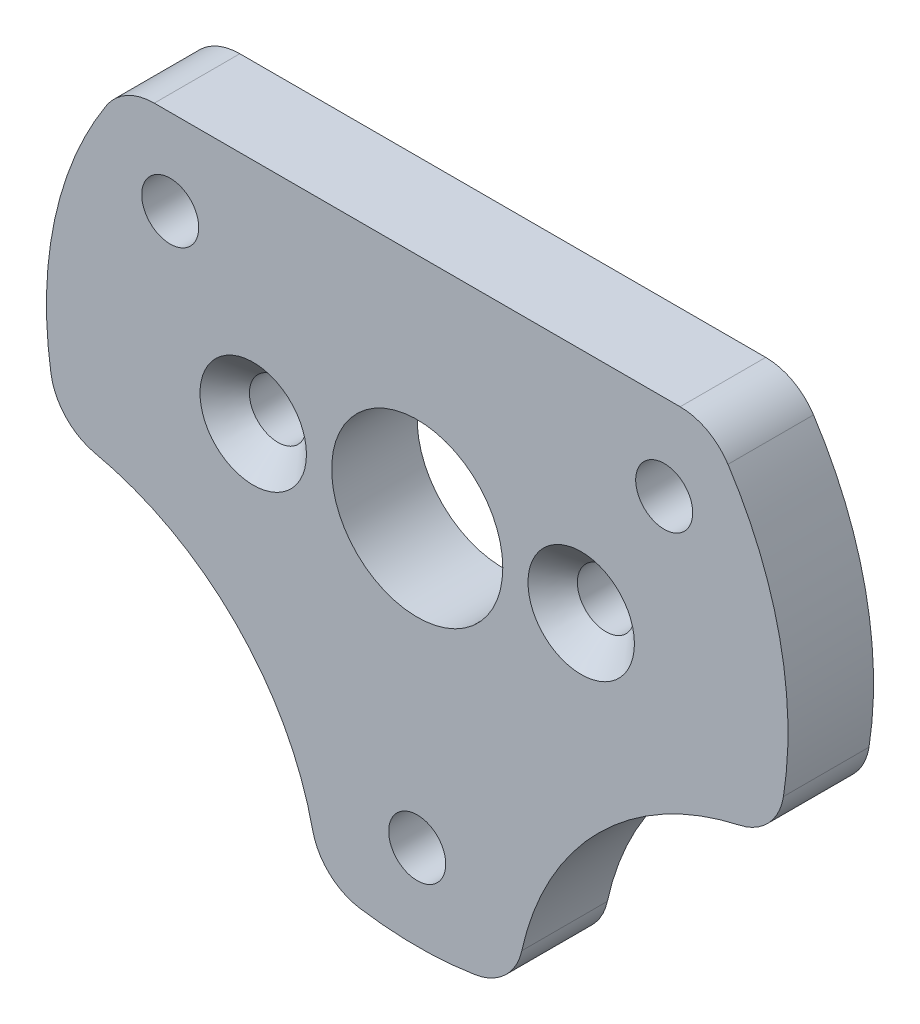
ISO-10303-21;
HEADER;
FILE_DESCRIPTION(('STEP AP214'),'2;1');
FILE_NAME('part.step','',(''),(''),'','','');
FILE_SCHEMA(('AUTOMOTIVE_DESIGN { 1 0 10303 214 1 1 1 1 }'));
ENDSEC;
DATA;
#1=APPLICATION_CONTEXT('core data for automotive mechanical design processes');
#2=APPLICATION_PROTOCOL_DEFINITION('international standard','automotive_design',2000,#1);
#3=PRODUCT_CONTEXT('',#1,'mechanical');
#4=PRODUCT('Part','Part','',(#3));
#5=PRODUCT_RELATED_PRODUCT_CATEGORY('part','',(#4));
#6=PRODUCT_DEFINITION_FORMATION('','',#4);
#7=PRODUCT_DEFINITION_CONTEXT('part definition',#1,'design');
#8=PRODUCT_DEFINITION('design','',#6,#7);
#9=PRODUCT_DEFINITION_SHAPE('','',#8);
#10=(LENGTH_UNIT() NAMED_UNIT(*) SI_UNIT(.MILLI.,.METRE.));
#11=(NAMED_UNIT(*) PLANE_ANGLE_UNIT() SI_UNIT($,.RADIAN.));
#12=(NAMED_UNIT(*) SI_UNIT($,.STERADIAN.) SOLID_ANGLE_UNIT());
#13=UNCERTAINTY_MEASURE_WITH_UNIT(LENGTH_MEASURE(1.E-05),#10,'distance_accuracy_value','');
#14=(GEOMETRIC_REPRESENTATION_CONTEXT(3) GLOBAL_UNCERTAINTY_ASSIGNED_CONTEXT((#13)) GLOBAL_UNIT_ASSIGNED_CONTEXT((#10,
#11,#12)) REPRESENTATION_CONTEXT('',''));
#15=CARTESIAN_POINT('',(0.,0.,0.));
#16=DIRECTION('',(0.,0.,1.));
#17=DIRECTION('',(1.,0.,0.));
#18=AXIS2_PLACEMENT_3D('',#15,#16,#17);
#19=CARTESIAN_POINT('',(0.,0.,3.));
#20=DIRECTION('',(0.,0.,-1.));
#21=DIRECTION('',(-1.,0.,0.));
#22=AXIS2_PLACEMENT_3D('',#19,#20,#21);
#23=CYLINDRICAL_SURFACE('',#22,13.);
#24=CARTESIAN_POINT('',(0.,0.,0.));
#25=DIRECTION('',(0.,0.,1.));
#26=DIRECTION('',(1.,0.,0.));
#27=AXIS2_PLACEMENT_3D('',#24,#25,#26);
#28=CIRCLE('',#27,13.);
#29=CARTESIAN_POINT('',(-2.02481441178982,-12.8413444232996,0.));
#30=VERTEX_POINT('',#29);
#31=CARTESIAN_POINT('',(2.02481441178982,-12.8413444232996,0.));
#32=VERTEX_POINT('',#31);
#33=EDGE_CURVE('E259',#30,#32,#28,.T.);
#34=ORIENTED_EDGE('',*,*,#33,.T.);
#35=DIRECTION('',(0.,0.,-1.));
#36=VECTOR('',#35,1.);
#37=CARTESIAN_POINT('',(2.02481441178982,-12.8413444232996,3.));
#38=LINE('',#37,#36);
#39=CARTESIAN_POINT('',(2.02481441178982,-12.8413444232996,3.));
#40=VERTEX_POINT('',#39);
#41=EDGE_CURVE('E183',#32,#40,#38,.F.);
#42=ORIENTED_EDGE('',*,*,#41,.T.);
#43=CARTESIAN_POINT('',(0.,0.,3.));
#44=DIRECTION('',(0.,0.,1.));
#45=DIRECTION('',(1.,0.,0.));
#46=AXIS2_PLACEMENT_3D('',#43,#44,#45);
#47=CIRCLE('',#46,13.);
#48=CARTESIAN_POINT('',(-2.02481441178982,-12.8413444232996,3.));
#49=VERTEX_POINT('',#48);
#50=EDGE_CURVE('E147',#49,#40,#47,.T.);
#51=ORIENTED_EDGE('',*,*,#50,.F.);
#52=DIRECTION('',(0.,0.,-1.));
#53=VECTOR('',#52,1.);
#54=CARTESIAN_POINT('',(-2.02481441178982,-12.8413444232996,3.));
#55=LINE('',#54,#53);
#56=EDGE_CURVE('E137',#49,#30,#55,.T.);
#57=ORIENTED_EDGE('',*,*,#56,.T.);
#58=EDGE_LOOP('',(#34,#42,#51,#57));
#59=FACE_BOUND('',#58,.T.);
#60=ADVANCED_FACE('F34',(#59),#23,.T.);
#61=CARTESIAN_POINT('',(-10.8958252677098,7.09090909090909,0.));
#62=VERTEX_POINT('',#61);
#63=CARTESIAN_POINT('',(-12.8413444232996,-2.02481441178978,0.));
#64=VERTEX_POINT('',#63);
#65=EDGE_CURVE('E257',#62,#64,#28,.T.);
#66=ORIENTED_EDGE('',*,*,#65,.T.);
#67=DIRECTION('',(0.,0.,-1.));
#68=VECTOR('',#67,1.);
#69=CARTESIAN_POINT('',(-12.8413444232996,-2.02481441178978,3.));
#70=LINE('',#69,#68);
#71=CARTESIAN_POINT('',(-12.8413444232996,-2.02481441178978,3.));
#72=VERTEX_POINT('',#71);
#73=EDGE_CURVE('E192',#64,#72,#70,.F.);
#74=ORIENTED_EDGE('',*,*,#73,.T.);
#75=CARTESIAN_POINT('',(-10.8958252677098,7.09090909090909,3.));
#76=VERTEX_POINT('',#75);
#77=EDGE_CURVE('E150',#76,#72,#47,.T.);
#78=ORIENTED_EDGE('',*,*,#77,.F.);
#79=DIRECTION('',(0.,0.,-1.));
#80=VECTOR('',#79,1.);
#81=CARTESIAN_POINT('',(-10.8958252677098,7.09090909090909,3.));
#82=LINE('',#81,#80);
#83=EDGE_CURVE('E189',#76,#62,#82,.T.);
#84=ORIENTED_EDGE('',*,*,#83,.T.);
#85=EDGE_LOOP('',(#66,#74,#78,#84));
#86=FACE_BOUND('',#85,.T.);
#87=ADVANCED_FACE('F274',(#86),#23,.T.);
#88=CARTESIAN_POINT('',(0.,0.,3.));
#89=DIRECTION('',(0.,0.,1.));
#90=DIRECTION('',(1.,0.,0.));
#91=AXIS2_PLACEMENT_3D('',#88,#89,#90);
#92=PLANE('',#91);
#93=CARTESIAN_POINT('',(5.75,0.,3.));
#94=DIRECTION('',(0.,0.,1.));
#95=DIRECTION('',(1.,0.,0.));
#96=AXIS2_PLACEMENT_3D('',#93,#94,#95);
#97=CIRCLE('',#96,1.866);
#98=CARTESIAN_POINT('',(7.616,0.,3.));
#99=VERTEX_POINT('',#98);
#100=EDGE_CURVE('E42',#99,#99,#97,.F.);
#101=ORIENTED_EDGE('',*,*,#100,.T.);
#102=EDGE_LOOP('',(#101));
#103=FACE_BOUND('',#102,.T.);
#104=CARTESIAN_POINT('',(-5.75,0.,3.));
#105=DIRECTION('',(0.,0.,1.));
#106=DIRECTION('',(1.,0.,0.));
#107=AXIS2_PLACEMENT_3D('',#104,#105,#106);
#108=CIRCLE('',#107,1.866);
#109=CARTESIAN_POINT('',(-3.884,0.,3.));
#110=VERTEX_POINT('',#109);
#111=EDGE_CURVE('E203',#110,#110,#108,.F.);
#112=ORIENTED_EDGE('',*,*,#111,.T.);
#113=EDGE_LOOP('',(#112));
#114=FACE_BOUND('',#113,.T.);
#115=CARTESIAN_POINT('',(13.4350288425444,-13.4350288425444,3.));
#116=DIRECTION('',(0.,0.,1.));
#117=DIRECTION('',(1.,0.,0.));
#118=AXIS2_PLACEMENT_3D('',#115,#116,#117);
#119=CIRCLE('',#118,10.);
#120=CARTESIAN_POINT('',(11.2939656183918,-3.66692522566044,3.));
#121=VERTEX_POINT('',#120);
#122=CARTESIAN_POINT('',(3.66692522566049,-11.2939656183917,3.));
#123=VERTEX_POINT('',#122);
#124=EDGE_CURVE('E133',#121,#123,#119,.T.);
#125=ORIENTED_EDGE('',*,*,#124,.F.);
#126=CARTESIAN_POINT('',(10.8657529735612,-1.71330450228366,3.));
#127=DIRECTION('',(0.,0.,1.));
#128=DIRECTION('',(1.,0.,0.));
#129=AXIS2_PLACEMENT_3D('',#126,#127,#128);
#130=CIRCLE('',#129,2.);
#131=CARTESIAN_POINT('',(12.8413444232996,-2.02481441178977,3.));
#132=VERTEX_POINT('',#131);
#133=EDGE_CURVE('E126',#121,#132,#130,.T.);
#134=ORIENTED_EDGE('',*,*,#133,.T.);
#135=CARTESIAN_POINT('',(10.8958252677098,7.09090909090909,3.));
#136=VERTEX_POINT('',#135);
#137=EDGE_CURVE('E130',#132,#136,#47,.T.);
#138=ORIENTED_EDGE('',*,*,#137,.T.);
#139=CARTESIAN_POINT('',(9.21954445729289,6.,3.));
#140=DIRECTION('',(0.,0.,1.));
#141=DIRECTION('',(1.,0.,0.));
#142=AXIS2_PLACEMENT_3D('',#139,#140,#141);
#143=CIRCLE('',#142,2.);
#144=CARTESIAN_POINT('',(9.21954445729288,8.,3.));
#145=VERTEX_POINT('',#144);
#146=EDGE_CURVE('E175',#136,#145,#143,.T.);
#147=ORIENTED_EDGE('',*,*,#146,.T.);
#148=DIRECTION('',(-1.,0.,0.));
#149=VECTOR('',#148,1.);
#150=CARTESIAN_POINT('',(-10.2469507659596,8.,3.));
#151=LINE('',#150,#149);
#152=CARTESIAN_POINT('',(-9.21954445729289,8.,3.));
#153=VERTEX_POINT('',#152);
#154=EDGE_CURVE('E157',#145,#153,#151,.T.);
#155=ORIENTED_EDGE('',*,*,#154,.T.);
#156=CARTESIAN_POINT('',(-9.21954445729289,6.,3.));
#157=DIRECTION('',(0.,0.,1.));
#158=DIRECTION('',(1.,0.,0.));
#159=AXIS2_PLACEMENT_3D('',#156,#157,#158);
#160=CIRCLE('',#159,2.);
#161=EDGE_CURVE('E173',#153,#76,#160,.T.);
#162=ORIENTED_EDGE('',*,*,#161,.T.);
#163=ORIENTED_EDGE('',*,*,#77,.T.);
#164=CARTESIAN_POINT('',(-10.8657529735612,-1.71330450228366,3.));
#165=DIRECTION('',(0.,0.,1.));
#166=DIRECTION('',(1.,0.,0.));
#167=AXIS2_PLACEMENT_3D('',#164,#165,#166);
#168=CIRCLE('',#167,2.);
#169=CARTESIAN_POINT('',(-11.2939656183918,-3.66692522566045,3.));
#170=VERTEX_POINT('',#169);
#171=EDGE_CURVE('E177',#72,#170,#168,.T.);
#172=ORIENTED_EDGE('',*,*,#171,.T.);
#173=CARTESIAN_POINT('',(-13.4350288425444,-13.4350288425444,3.));
#174=DIRECTION('',(0.,0.,1.));
#175=DIRECTION('',(-1.,0.,0.));
#176=AXIS2_PLACEMENT_3D('',#173,#174,#175);
#177=CIRCLE('',#176,10.);
#178=CARTESIAN_POINT('',(-3.66692522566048,-11.2939656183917,3.));
#179=VERTEX_POINT('',#178);
#180=EDGE_CURVE('E282',#179,#170,#177,.T.);
#181=ORIENTED_EDGE('',*,*,#180,.F.);
#182=CARTESIAN_POINT('',(-1.71330450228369,-10.8657529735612,3.));
#183=DIRECTION('',(0.,0.,1.));
#184=DIRECTION('',(1.,0.,0.));
#185=AXIS2_PLACEMENT_3D('',#182,#183,#184);
#186=CIRCLE('',#185,2.);
#187=EDGE_CURVE('E57',#179,#49,#186,.T.);
#188=ORIENTED_EDGE('',*,*,#187,.T.);
#189=ORIENTED_EDGE('',*,*,#50,.T.);
#190=CARTESIAN_POINT('',(1.7133045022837,-10.8657529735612,3.));
#191=DIRECTION('',(0.,0.,1.));
#192=DIRECTION('',(1.,0.,0.));
#193=AXIS2_PLACEMENT_3D('',#190,#191,#192);
#194=CIRCLE('',#193,2.);
#195=EDGE_CURVE('E49',#40,#123,#194,.T.);
#196=ORIENTED_EDGE('',*,*,#195,.T.);
#197=EDGE_LOOP('',(#125,#134,#138,#147,#155,#162,#163,#172,#181,#188,#189,#196));
#198=FACE_BOUND('',#197,.T.);
#199=CARTESIAN_POINT('',(8.66025403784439,5.,3.));
#200=DIRECTION('',(0.,0.,1.));
#201=DIRECTION('',(1.,0.,0.));
#202=AXIS2_PLACEMENT_3D('',#199,#200,#201);
#203=CIRCLE('',#202,1.);
#204=CARTESIAN_POINT('',(9.66025403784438,5.,3.));
#205=VERTEX_POINT('',#204);
#206=EDGE_CURVE('E237',#205,#205,#203,.T.);
#207=ORIENTED_EDGE('',*,*,#206,.F.);
#208=EDGE_LOOP('',(#207));
#209=FACE_BOUND('',#208,.T.);
#210=CARTESIAN_POINT('',(0.,-10.,3.));
#211=DIRECTION('',(0.,0.,1.));
#212=DIRECTION('',(1.,0.,0.));
#213=AXIS2_PLACEMENT_3D('',#210,#211,#212);
#214=CIRCLE('',#213,1.);
#215=CARTESIAN_POINT('',(1.,-10.,3.));
#216=VERTEX_POINT('',#215);
#217=EDGE_CURVE('E249',#216,#216,#214,.T.);
#218=ORIENTED_EDGE('',*,*,#217,.F.);
#219=EDGE_LOOP('',(#218));
#220=FACE_BOUND('',#219,.T.);
#221=CARTESIAN_POINT('',(-8.66025403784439,5.,3.));
#222=DIRECTION('',(0.,0.,1.));
#223=DIRECTION('',(1.,0.,0.));
#224=AXIS2_PLACEMENT_3D('',#221,#222,#223);
#225=CIRCLE('',#224,1.);
#226=CARTESIAN_POINT('',(-7.66025403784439,5.,3.));
#227=VERTEX_POINT('',#226);
#228=EDGE_CURVE('E243',#227,#227,#225,.T.);
#229=ORIENTED_EDGE('',*,*,#228,.F.);
#230=EDGE_LOOP('',(#229));
#231=FACE_BOUND('',#230,.T.);
#232=CARTESIAN_POINT('',(0.,0.,3.));
#233=DIRECTION('',(0.,0.,1.));
#234=DIRECTION('',(1.,0.,0.));
#235=AXIS2_PLACEMENT_3D('',#232,#233,#234);
#236=CIRCLE('',#235,3.);
#237=CARTESIAN_POINT('',(3.,0.,3.));
#238=VERTEX_POINT('',#237);
#239=EDGE_CURVE('E227',#238,#238,#236,.T.);
#240=ORIENTED_EDGE('',*,*,#239,.F.);
#241=EDGE_LOOP('',(#240));
#242=FACE_BOUND('',#241,.T.);
#243=ADVANCED_FACE('F128',(#103,#114,#198,#209,#220,#231,#242),#92,.T.);
#244=CARTESIAN_POINT('',(0.,0.,0.));
#245=DIRECTION('',(0.,0.,1.));
#246=DIRECTION('',(1.,0.,0.));
#247=AXIS2_PLACEMENT_3D('',#244,#245,#246);
#248=PLANE('',#247);
#249=CARTESIAN_POINT('',(12.8413444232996,-2.02481441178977,0.));
#250=VERTEX_POINT('',#249);
#251=CARTESIAN_POINT('',(10.8958252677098,7.09090909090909,0.));
#252=VERTEX_POINT('',#251);
#253=EDGE_CURVE('E252',#250,#252,#28,.T.);
#254=ORIENTED_EDGE('',*,*,#253,.F.);
#255=CARTESIAN_POINT('',(10.8657529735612,-1.71330450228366,0.));
#256=DIRECTION('',(0.,0.,1.));
#257=DIRECTION('',(1.,0.,0.));
#258=AXIS2_PLACEMENT_3D('',#255,#256,#257);
#259=CIRCLE('',#258,2.);
#260=CARTESIAN_POINT('',(11.2939656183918,-3.66692522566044,0.));
#261=VERTEX_POINT('',#260);
#262=EDGE_CURVE('E152',#250,#261,#259,.F.);
#263=ORIENTED_EDGE('',*,*,#262,.T.);
#264=CARTESIAN_POINT('',(13.4350288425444,-13.4350288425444,0.));
#265=DIRECTION('',(0.,0.,1.));
#266=DIRECTION('',(1.,0.,0.));
#267=AXIS2_PLACEMENT_3D('',#264,#265,#266);
#268=CIRCLE('',#267,10.);
#269=CARTESIAN_POINT('',(3.66692522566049,-11.2939656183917,0.));
#270=VERTEX_POINT('',#269);
#271=EDGE_CURVE('E289',#261,#270,#268,.T.);
#272=ORIENTED_EDGE('',*,*,#271,.T.);
#273=CARTESIAN_POINT('',(1.7133045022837,-10.8657529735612,0.));
#274=DIRECTION('',(0.,0.,1.));
#275=DIRECTION('',(1.,0.,0.));
#276=AXIS2_PLACEMENT_3D('',#273,#274,#275);
#277=CIRCLE('',#276,2.);
#278=EDGE_CURVE('E166',#270,#32,#277,.F.);
#279=ORIENTED_EDGE('',*,*,#278,.T.);
#280=ORIENTED_EDGE('',*,*,#33,.F.);
#281=CARTESIAN_POINT('',(-1.71330450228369,-10.8657529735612,0.));
#282=DIRECTION('',(0.,0.,1.));
#283=DIRECTION('',(1.,0.,0.));
#284=AXIS2_PLACEMENT_3D('',#281,#282,#283);
#285=CIRCLE('',#284,2.);
#286=CARTESIAN_POINT('',(-3.66692522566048,-11.2939656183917,0.));
#287=VERTEX_POINT('',#286);
#288=EDGE_CURVE('E164',#30,#287,#285,.F.);
#289=ORIENTED_EDGE('',*,*,#288,.T.);
#290=CARTESIAN_POINT('',(-13.4350288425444,-13.4350288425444,0.));
#291=DIRECTION('',(0.,0.,1.));
#292=DIRECTION('',(1.,0.,0.));
#293=AXIS2_PLACEMENT_3D('',#290,#291,#292);
#294=CIRCLE('',#293,10.);
#295=CARTESIAN_POINT('',(-11.2939656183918,-3.66692522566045,0.));
#296=VERTEX_POINT('',#295);
#297=EDGE_CURVE('E288',#287,#296,#294,.T.);
#298=ORIENTED_EDGE('',*,*,#297,.T.);
#299=CARTESIAN_POINT('',(-10.8657529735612,-1.71330450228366,0.));
#300=DIRECTION('',(0.,0.,1.));
#301=DIRECTION('',(1.,0.,0.));
#302=AXIS2_PLACEMENT_3D('',#299,#300,#301);
#303=CIRCLE('',#302,2.);
#304=EDGE_CURVE('E162',#296,#64,#303,.F.);
#305=ORIENTED_EDGE('',*,*,#304,.T.);
#306=ORIENTED_EDGE('',*,*,#65,.F.);
#307=CARTESIAN_POINT('',(-9.21954445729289,6.,0.));
#308=DIRECTION('',(0.,0.,1.));
#309=DIRECTION('',(1.,0.,0.));
#310=AXIS2_PLACEMENT_3D('',#307,#308,#309);
#311=CIRCLE('',#310,2.);
#312=CARTESIAN_POINT('',(-9.21954445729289,8.,0.));
#313=VERTEX_POINT('',#312);
#314=EDGE_CURVE('E153',#62,#313,#311,.F.);
#315=ORIENTED_EDGE('',*,*,#314,.T.);
#316=DIRECTION('',(-1.,0.,0.));
#317=VECTOR('',#316,1.);
#318=CARTESIAN_POINT('',(-10.2469507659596,8.,0.));
#319=LINE('',#318,#317);
#320=CARTESIAN_POINT('',(9.21954445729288,8.,0.));
#321=VERTEX_POINT('',#320);
#322=EDGE_CURVE('E148',#321,#313,#319,.T.);
#323=ORIENTED_EDGE('',*,*,#322,.F.);
#324=CARTESIAN_POINT('',(9.21954445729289,6.,0.));
#325=DIRECTION('',(0.,0.,1.));
#326=DIRECTION('',(1.,0.,0.));
#327=AXIS2_PLACEMENT_3D('',#324,#325,#326);
#328=CIRCLE('',#327,2.);
#329=EDGE_CURVE('E155',#321,#252,#328,.F.);
#330=ORIENTED_EDGE('',*,*,#329,.T.);
#331=EDGE_LOOP('',(#254,#263,#272,#279,#280,#289,#298,#305,#306,#315,#323,#330));
#332=FACE_BOUND('',#331,.T.);
#333=CARTESIAN_POINT('',(0.,-10.,0.));
#334=DIRECTION('',(0.,0.,1.));
#335=DIRECTION('',(1.,0.,0.));
#336=AXIS2_PLACEMENT_3D('',#333,#334,#335);
#337=CIRCLE('',#336,1.);
#338=CARTESIAN_POINT('',(1.,-10.,0.));
#339=VERTEX_POINT('',#338);
#340=EDGE_CURVE('E246',#339,#339,#337,.T.);
#341=ORIENTED_EDGE('',*,*,#340,.T.);
#342=EDGE_LOOP('',(#341));
#343=FACE_BOUND('',#342,.T.);
#344=CARTESIAN_POINT('',(-8.66025403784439,5.,0.));
#345=DIRECTION('',(0.,0.,1.));
#346=DIRECTION('',(1.,0.,0.));
#347=AXIS2_PLACEMENT_3D('',#344,#345,#346);
#348=CIRCLE('',#347,1.);
#349=CARTESIAN_POINT('',(-7.66025403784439,5.,0.));
#350=VERTEX_POINT('',#349);
#351=EDGE_CURVE('E240',#350,#350,#348,.T.);
#352=ORIENTED_EDGE('',*,*,#351,.T.);
#353=EDGE_LOOP('',(#352));
#354=FACE_BOUND('',#353,.T.);
#355=CARTESIAN_POINT('',(8.66025403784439,5.,0.));
#356=DIRECTION('',(0.,0.,1.));
#357=DIRECTION('',(1.,0.,0.));
#358=AXIS2_PLACEMENT_3D('',#355,#356,#357);
#359=CIRCLE('',#358,1.);
#360=CARTESIAN_POINT('',(9.66025403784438,5.,0.));
#361=VERTEX_POINT('',#360);
#362=EDGE_CURVE('E230',#361,#361,#359,.T.);
#363=ORIENTED_EDGE('',*,*,#362,.T.);
#364=EDGE_LOOP('',(#363));
#365=FACE_BOUND('',#364,.T.);
#366=CARTESIAN_POINT('',(-5.75,0.,0.));
#367=DIRECTION('',(0.,0.,1.));
#368=DIRECTION('',(1.,0.,0.));
#369=AXIS2_PLACEMENT_3D('',#366,#367,#368);
#370=CIRCLE('',#369,1.);
#371=CARTESIAN_POINT('',(-4.75,0.,0.));
#372=VERTEX_POINT('',#371);
#373=EDGE_CURVE('E226',#372,#372,#370,.T.);
#374=ORIENTED_EDGE('',*,*,#373,.T.);
#375=EDGE_LOOP('',(#374));
#376=FACE_BOUND('',#375,.T.);
#377=CARTESIAN_POINT('',(5.75,0.,0.));
#378=DIRECTION('',(0.,0.,1.));
#379=DIRECTION('',(-1.,0.,0.));
#380=AXIS2_PLACEMENT_3D('',#377,#378,#379);
#381=CIRCLE('',#380,1.);
#382=CARTESIAN_POINT('',(4.75,0.,0.));
#383=VERTEX_POINT('',#382);
#384=EDGE_CURVE('E224',#383,#383,#381,.T.);
#385=ORIENTED_EDGE('',*,*,#384,.T.);
#386=EDGE_LOOP('',(#385));
#387=FACE_BOUND('',#386,.T.);
#388=CARTESIAN_POINT('',(0.,0.,0.));
#389=DIRECTION('',(0.,0.,1.));
#390=DIRECTION('',(1.,0.,0.));
#391=AXIS2_PLACEMENT_3D('',#388,#389,#390);
#392=CIRCLE('',#391,3.);
#393=CARTESIAN_POINT('',(3.,0.,0.));
#394=VERTEX_POINT('',#393);
#395=EDGE_CURVE('E233',#394,#394,#392,.T.);
#396=ORIENTED_EDGE('',*,*,#395,.T.);
#397=EDGE_LOOP('',(#396));
#398=FACE_BOUND('',#397,.T.);
#399=ADVANCED_FACE('F302',(#332,#343,#354,#365,#376,#387,#398),#248,.F.);
#400=ORIENTED_EDGE('',*,*,#137,.F.);
#401=DIRECTION('',(0.,0.,-1.));
#402=VECTOR('',#401,1.);
#403=CARTESIAN_POINT('',(12.8413444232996,-2.02481441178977,3.));
#404=LINE('',#403,#402);
#405=EDGE_CURVE('E143',#132,#250,#404,.T.);
#406=ORIENTED_EDGE('',*,*,#405,.T.);
#407=ORIENTED_EDGE('',*,*,#253,.T.);
#408=DIRECTION('',(0.,0.,-1.));
#409=VECTOR('',#408,1.);
#410=CARTESIAN_POINT('',(10.8958252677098,7.09090909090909,3.));
#411=LINE('',#410,#409);
#412=EDGE_CURVE('E146',#252,#136,#411,.F.);
#413=ORIENTED_EDGE('',*,*,#412,.T.);
#414=EDGE_LOOP('',(#400,#406,#407,#413));
#415=FACE_BOUND('',#414,.T.);
#416=ADVANCED_FACE('F141',(#415),#23,.T.);
#417=CARTESIAN_POINT('',(-10.2469507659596,8.,3.));
#418=DIRECTION('',(0.,-1.,0.));
#419=DIRECTION('',(0.,0.,-1.));
#420=AXIS2_PLACEMENT_3D('',#417,#418,#419);
#421=PLANE('',#420);
#422=ORIENTED_EDGE('',*,*,#154,.F.);
#423=DIRECTION('',(0.,0.,-1.));
#424=VECTOR('',#423,1.);
#425=CARTESIAN_POINT('',(9.21954445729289,8.,3.));
#426=LINE('',#425,#424);
#427=EDGE_CURVE('E197',#145,#321,#426,.T.);
#428=ORIENTED_EDGE('',*,*,#427,.T.);
#429=ORIENTED_EDGE('',*,*,#322,.T.);
#430=DIRECTION('',(0.,0.,-1.));
#431=VECTOR('',#430,1.);
#432=CARTESIAN_POINT('',(-9.21954445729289,8.,3.));
#433=LINE('',#432,#431);
#434=EDGE_CURVE('E195',#313,#153,#433,.F.);
#435=ORIENTED_EDGE('',*,*,#434,.T.);
#436=EDGE_LOOP('',(#422,#428,#429,#435));
#437=FACE_BOUND('',#436,.T.);
#438=ADVANCED_FACE('F265',(#437),#421,.F.);
#439=CARTESIAN_POINT('',(0.,-10.,3.));
#440=DIRECTION('',(0.,0.,-1.));
#441=DIRECTION('',(-1.,0.,0.));
#442=AXIS2_PLACEMENT_3D('',#439,#440,#441);
#443=CYLINDRICAL_SURFACE('',#442,1.);
#444=ORIENTED_EDGE('',*,*,#217,.T.);
#445=EDGE_LOOP('',(#444));
#446=FACE_BOUND('',#445,.T.);
#447=ORIENTED_EDGE('',*,*,#340,.F.);
#448=EDGE_LOOP('',(#447));
#449=FACE_BOUND('',#448,.T.);
#450=ADVANCED_FACE('F329',(#446,#449),#443,.F.);
#451=CARTESIAN_POINT('',(-8.66025403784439,5.,3.));
#452=DIRECTION('',(0.,0.,-1.));
#453=DIRECTION('',(-1.,0.,0.));
#454=AXIS2_PLACEMENT_3D('',#451,#452,#453);
#455=CYLINDRICAL_SURFACE('',#454,1.);
#456=ORIENTED_EDGE('',*,*,#228,.T.);
#457=EDGE_LOOP('',(#456));
#458=FACE_BOUND('',#457,.T.);
#459=ORIENTED_EDGE('',*,*,#351,.F.);
#460=EDGE_LOOP('',(#459));
#461=FACE_BOUND('',#460,.T.);
#462=ADVANCED_FACE('F338',(#458,#461),#455,.F.);
#463=CARTESIAN_POINT('',(8.66025403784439,5.,3.));
#464=DIRECTION('',(0.,0.,-1.));
#465=DIRECTION('',(-1.,0.,0.));
#466=AXIS2_PLACEMENT_3D('',#463,#464,#465);
#467=CYLINDRICAL_SURFACE('',#466,1.);
#468=ORIENTED_EDGE('',*,*,#206,.T.);
#469=EDGE_LOOP('',(#468));
#470=FACE_BOUND('',#469,.T.);
#471=ORIENTED_EDGE('',*,*,#362,.F.);
#472=EDGE_LOOP('',(#471));
#473=FACE_BOUND('',#472,.T.);
#474=ADVANCED_FACE('F342',(#470,#473),#467,.F.);
#475=CARTESIAN_POINT('',(-5.75,0.,3.));
#476=DIRECTION('',(0.,0.,-1.));
#477=DIRECTION('',(-1.,0.,0.));
#478=AXIS2_PLACEMENT_3D('',#475,#476,#477);
#479=CYLINDRICAL_SURFACE('',#478,1.);
#480=CARTESIAN_POINT('',(-5.75,0.,2.134));
#481=DIRECTION('',(0.,0.,1.));
#482=DIRECTION('',(1.,0.,0.));
#483=AXIS2_PLACEMENT_3D('',#480,#481,#482);
#484=CIRCLE('',#483,1.);
#485=CARTESIAN_POINT('',(-4.75,0.,2.134));
#486=VERTEX_POINT('',#485);
#487=EDGE_CURVE('E11',#486,#486,#484,.T.);
#488=ORIENTED_EDGE('',*,*,#487,.T.);
#489=EDGE_LOOP('',(#488));
#490=FACE_BOUND('',#489,.T.);
#491=ORIENTED_EDGE('',*,*,#373,.F.);
#492=EDGE_LOOP('',(#491));
#493=FACE_BOUND('',#492,.T.);
#494=ADVANCED_FACE('F220',(#490,#493),#479,.F.);
#495=CARTESIAN_POINT('',(5.75,0.,3.));
#496=DIRECTION('',(0.,0.,-1.));
#497=DIRECTION('',(-1.,0.,0.));
#498=AXIS2_PLACEMENT_3D('',#495,#496,#497);
#499=CYLINDRICAL_SURFACE('',#498,1.);
#500=CARTESIAN_POINT('',(5.75,0.,2.134));
#501=DIRECTION('',(0.,0.,1.));
#502=DIRECTION('',(1.,0.,0.));
#503=AXIS2_PLACEMENT_3D('',#500,#501,#502);
#504=CIRCLE('',#503,1.);
#505=CARTESIAN_POINT('',(6.75,0.,2.134));
#506=VERTEX_POINT('',#505);
#507=EDGE_CURVE('E200',#506,#506,#504,.T.);
#508=ORIENTED_EDGE('',*,*,#507,.T.);
#509=EDGE_LOOP('',(#508));
#510=FACE_BOUND('',#509,.T.);
#511=ORIENTED_EDGE('',*,*,#384,.F.);
#512=EDGE_LOOP('',(#511));
#513=FACE_BOUND('',#512,.T.);
#514=ADVANCED_FACE('F216',(#510,#513),#499,.F.);
#515=CARTESIAN_POINT('',(0.,0.,3.));
#516=DIRECTION('',(0.,0.,-1.));
#517=DIRECTION('',(-1.,0.,0.));
#518=AXIS2_PLACEMENT_3D('',#515,#516,#517);
#519=CYLINDRICAL_SURFACE('',#518,3.);
#520=ORIENTED_EDGE('',*,*,#239,.T.);
#521=EDGE_LOOP('',(#520));
#522=FACE_BOUND('',#521,.T.);
#523=ORIENTED_EDGE('',*,*,#395,.F.);
#524=EDGE_LOOP('',(#523));
#525=FACE_BOUND('',#524,.T.);
#526=ADVANCED_FACE('F219',(#522,#525),#519,.F.);
#527=CARTESIAN_POINT('',(-13.4350288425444,-13.4350288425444,-7.));
#528=DIRECTION('',(0.,0.,1.));
#529=DIRECTION('',(1.,0.,0.));
#530=AXIS2_PLACEMENT_3D('',#527,#528,#529);
#531=CYLINDRICAL_SURFACE('',#530,10.);
#532=ORIENTED_EDGE('',*,*,#297,.F.);
#533=DIRECTION('',(0.,0.,1.));
#534=VECTOR('',#533,1.);
#535=CARTESIAN_POINT('',(-3.66692522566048,-11.2939656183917,-7.));
#536=LINE('',#535,#534);
#537=EDGE_CURVE('E187',#287,#179,#536,.T.);
#538=ORIENTED_EDGE('',*,*,#537,.T.);
#539=ORIENTED_EDGE('',*,*,#180,.T.);
#540=DIRECTION('',(0.,0.,1.));
#541=VECTOR('',#540,1.);
#542=CARTESIAN_POINT('',(-11.2939656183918,-3.66692522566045,-7.));
#543=LINE('',#542,#541);
#544=EDGE_CURVE('E185',#170,#296,#543,.F.);
#545=ORIENTED_EDGE('',*,*,#544,.T.);
#546=EDGE_LOOP('',(#532,#538,#539,#545));
#547=FACE_BOUND('',#546,.T.);
#548=ADVANCED_FACE('F285',(#547),#531,.F.);
#549=CARTESIAN_POINT('',(13.4350288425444,-13.4350288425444,-7.));
#550=DIRECTION('',(0.,0.,1.));
#551=DIRECTION('',(1.,0.,0.));
#552=AXIS2_PLACEMENT_3D('',#549,#550,#551);
#553=CYLINDRICAL_SURFACE('',#552,10.);
#554=ORIENTED_EDGE('',*,*,#271,.F.);
#555=DIRECTION('',(0.,0.,1.));
#556=VECTOR('',#555,1.);
#557=CARTESIAN_POINT('',(11.2939656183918,-3.66692522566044,-7.));
#558=LINE('',#557,#556);
#559=EDGE_CURVE('E171',#261,#121,#558,.T.);
#560=ORIENTED_EDGE('',*,*,#559,.T.);
#561=ORIENTED_EDGE('',*,*,#124,.T.);
#562=DIRECTION('',(0.,0.,1.));
#563=VECTOR('',#562,1.);
#564=CARTESIAN_POINT('',(3.66692522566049,-11.2939656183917,-7.));
#565=LINE('',#564,#563);
#566=EDGE_CURVE('E169',#123,#270,#565,.F.);
#567=ORIENTED_EDGE('',*,*,#566,.T.);
#568=EDGE_LOOP('',(#554,#560,#561,#567));
#569=FACE_BOUND('',#568,.T.);
#570=ADVANCED_FACE('F297',(#569),#553,.F.);
#571=CARTESIAN_POINT('',(10.8657529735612,-1.71330450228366,-7.));
#572=DIRECTION('',(0.,0.,1.));
#573=DIRECTION('',(1.,0.,0.));
#574=AXIS2_PLACEMENT_3D('',#571,#572,#573);
#575=CYLINDRICAL_SURFACE('',#574,2.);
#576=ORIENTED_EDGE('',*,*,#133,.F.);
#577=ORIENTED_EDGE('',*,*,#559,.F.);
#578=ORIENTED_EDGE('',*,*,#262,.F.);
#579=ORIENTED_EDGE('',*,*,#405,.F.);
#580=EDGE_LOOP('',(#576,#577,#578,#579));
#581=FACE_BOUND('',#580,.T.);
#582=ADVANCED_FACE('F151',(#581),#575,.T.);
#583=CARTESIAN_POINT('',(1.7133045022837,-10.8657529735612,-7.));
#584=DIRECTION('',(0.,0.,-1.));
#585=DIRECTION('',(-1.,0.,0.));
#586=AXIS2_PLACEMENT_3D('',#583,#584,#585);
#587=CYLINDRICAL_SURFACE('',#586,2.);
#588=ORIENTED_EDGE('',*,*,#278,.F.);
#589=ORIENTED_EDGE('',*,*,#566,.F.);
#590=ORIENTED_EDGE('',*,*,#195,.F.);
#591=ORIENTED_EDGE('',*,*,#41,.F.);
#592=EDGE_LOOP('',(#588,#589,#590,#591));
#593=FACE_BOUND('',#592,.T.);
#594=ADVANCED_FACE('F299',(#593),#587,.T.);
#595=CARTESIAN_POINT('',(-1.71330450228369,-10.8657529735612,-7.));
#596=DIRECTION('',(0.,0.,1.));
#597=DIRECTION('',(1.,0.,0.));
#598=AXIS2_PLACEMENT_3D('',#595,#596,#597);
#599=CYLINDRICAL_SURFACE('',#598,2.);
#600=ORIENTED_EDGE('',*,*,#187,.F.);
#601=ORIENTED_EDGE('',*,*,#537,.F.);
#602=ORIENTED_EDGE('',*,*,#288,.F.);
#603=ORIENTED_EDGE('',*,*,#56,.F.);
#604=EDGE_LOOP('',(#600,#601,#602,#603));
#605=FACE_BOUND('',#604,.T.);
#606=ADVANCED_FACE('F315',(#605),#599,.T.);
#607=CARTESIAN_POINT('',(-10.8657529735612,-1.71330450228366,-7.));
#608=DIRECTION('',(0.,0.,-1.));
#609=DIRECTION('',(-1.,0.,0.));
#610=AXIS2_PLACEMENT_3D('',#607,#608,#609);
#611=CYLINDRICAL_SURFACE('',#610,2.);
#612=ORIENTED_EDGE('',*,*,#304,.F.);
#613=ORIENTED_EDGE('',*,*,#544,.F.);
#614=ORIENTED_EDGE('',*,*,#171,.F.);
#615=ORIENTED_EDGE('',*,*,#73,.F.);
#616=EDGE_LOOP('',(#612,#613,#614,#615));
#617=FACE_BOUND('',#616,.T.);
#618=ADVANCED_FACE('F279',(#617),#611,.T.);
#619=CARTESIAN_POINT('',(9.21954445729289,6.,3.));
#620=DIRECTION('',(0.,0.,-1.));
#621=DIRECTION('',(-1.,0.,0.));
#622=AXIS2_PLACEMENT_3D('',#619,#620,#621);
#623=CYLINDRICAL_SURFACE('',#622,2.);
#624=ORIENTED_EDGE('',*,*,#146,.F.);
#625=ORIENTED_EDGE('',*,*,#412,.F.);
#626=ORIENTED_EDGE('',*,*,#329,.F.);
#627=ORIENTED_EDGE('',*,*,#427,.F.);
#628=EDGE_LOOP('',(#624,#625,#626,#627));
#629=FACE_BOUND('',#628,.T.);
#630=ADVANCED_FACE('F307',(#629),#623,.T.);
#631=CARTESIAN_POINT('',(-9.21954445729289,6.,3.));
#632=DIRECTION('',(0.,0.,-1.));
#633=DIRECTION('',(-1.,0.,0.));
#634=AXIS2_PLACEMENT_3D('',#631,#632,#633);
#635=CYLINDRICAL_SURFACE('',#634,2.);
#636=ORIENTED_EDGE('',*,*,#161,.F.);
#637=ORIENTED_EDGE('',*,*,#434,.F.);
#638=ORIENTED_EDGE('',*,*,#314,.F.);
#639=ORIENTED_EDGE('',*,*,#83,.F.);
#640=EDGE_LOOP('',(#636,#637,#638,#639));
#641=FACE_BOUND('',#640,.T.);
#642=ADVANCED_FACE('F213',(#641),#635,.T.);
#643=CARTESIAN_POINT('',(5.75,0.,2.134));
#644=DIRECTION('',(0.,0.,1.));
#645=DIRECTION('',(1.,0.,0.));
#646=AXIS2_PLACEMENT_3D('',#643,#644,#645);
#647=CONICAL_SURFACE('',#646,1.,0.785398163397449);
#648=ORIENTED_EDGE('',*,*,#100,.F.);
#649=EDGE_LOOP('',(#648));
#650=FACE_BOUND('',#649,.T.);
#651=ORIENTED_EDGE('',*,*,#507,.F.);
#652=EDGE_LOOP('',(#651));
#653=FACE_BOUND('',#652,.T.);
#654=ADVANCED_FACE('F210',(#650,#653),#647,.F.);
#655=CARTESIAN_POINT('',(-5.75,0.,2.134));
#656=DIRECTION('',(0.,0.,1.));
#657=DIRECTION('',(1.,0.,0.));
#658=AXIS2_PLACEMENT_3D('',#655,#656,#657);
#659=CONICAL_SURFACE('',#658,1.,0.785398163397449);
#660=ORIENTED_EDGE('',*,*,#111,.F.);
#661=EDGE_LOOP('',(#660));
#662=FACE_BOUND('',#661,.T.);
#663=ORIENTED_EDGE('',*,*,#487,.F.);
#664=EDGE_LOOP('',(#663));
#665=FACE_BOUND('',#664,.T.);
#666=ADVANCED_FACE('F36',(#662,#665),#659,.F.);
#667=CLOSED_SHELL('',(#60,#87,#243,#399,#416,#438,#450,#462,#474,#494,#514,#526,#548,#570,#582,
#594,#606,#618,#630,#642,#654,#666));
#668=MANIFOLD_SOLID_BREP('B2',#667);
#669=ADVANCED_BREP_SHAPE_REPRESENTATION('',(#18,#668),#14);
#670=SHAPE_DEFINITION_REPRESENTATION(#9,#669);
ENDSEC;
END-ISO-10303-21;
